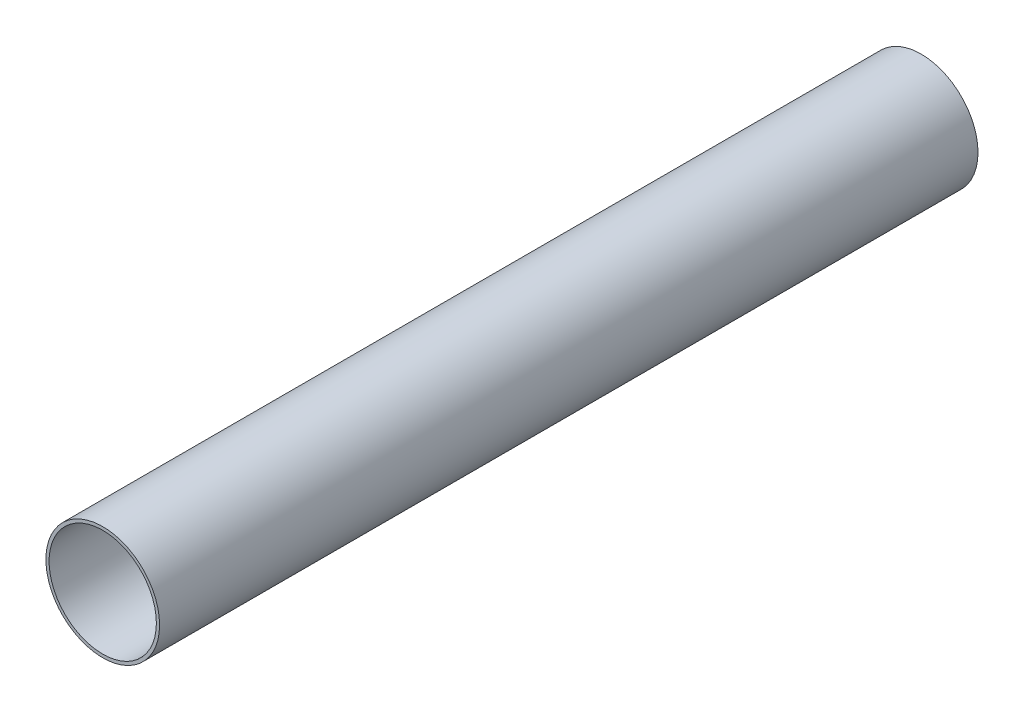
ISO-10303-21;
HEADER;
FILE_DESCRIPTION(('STEP AP214'),'2;1');
FILE_NAME('part.step','',(''),(''),'','','');
FILE_SCHEMA(('AUTOMOTIVE_DESIGN { 1 0 10303 214 1 1 1 1 }'));
ENDSEC;
DATA;
#1=APPLICATION_CONTEXT('core data for automotive mechanical design processes');
#2=APPLICATION_PROTOCOL_DEFINITION('international standard','automotive_design',2000,#1);
#3=PRODUCT_CONTEXT('',#1,'mechanical');
#4=PRODUCT('Part','Part','',(#3));
#5=PRODUCT_RELATED_PRODUCT_CATEGORY('part','',(#4));
#6=PRODUCT_DEFINITION_FORMATION('','',#4);
#7=PRODUCT_DEFINITION_CONTEXT('part definition',#1,'design');
#8=PRODUCT_DEFINITION('design','',#6,#7);
#9=PRODUCT_DEFINITION_SHAPE('','',#8);
#10=(LENGTH_UNIT() NAMED_UNIT(*) SI_UNIT(.MILLI.,.METRE.));
#11=(NAMED_UNIT(*) PLANE_ANGLE_UNIT() SI_UNIT($,.RADIAN.));
#12=(NAMED_UNIT(*) SI_UNIT($,.STERADIAN.) SOLID_ANGLE_UNIT());
#13=UNCERTAINTY_MEASURE_WITH_UNIT(LENGTH_MEASURE(1.E-05),#10,'distance_accuracy_value','');
#14=(GEOMETRIC_REPRESENTATION_CONTEXT(3) GLOBAL_UNCERTAINTY_ASSIGNED_CONTEXT((#13)) GLOBAL_UNIT_ASSIGNED_CONTEXT((#10,
#11,#12)) REPRESENTATION_CONTEXT('',''));
#15=CARTESIAN_POINT('',(0.,0.,0.));
#16=DIRECTION('',(0.,0.,1.));
#17=DIRECTION('',(1.,0.,0.));
#18=AXIS2_PLACEMENT_3D('',#15,#16,#17);
#19=CARTESIAN_POINT('',(0.,0.,457.2));
#20=DIRECTION('',(0.,0.,1.));
#21=DIRECTION('',(1.,0.,0.));
#22=AXIS2_PLACEMENT_3D('',#19,#20,#21);
#23=PLANE('',#22);
#24=CARTESIAN_POINT('',(0.,0.,457.2));
#25=DIRECTION('',(0.,0.,1.));
#26=DIRECTION('',(1.,0.,0.));
#27=AXIS2_PLACEMENT_3D('',#24,#25,#26);
#28=CIRCLE('',#27,31.75);
#29=CARTESIAN_POINT('',(31.75,0.,457.2));
#30=VERTEX_POINT('',#29);
#31=EDGE_CURVE('E10',#30,#30,#28,.T.);
#32=ORIENTED_EDGE('',*,*,#31,.T.);
#33=EDGE_LOOP('',(#32));
#34=FACE_BOUND('',#33,.T.);
#35=CARTESIAN_POINT('',(0.,0.,457.2));
#36=DIRECTION('',(0.,0.,1.));
#37=DIRECTION('',(1.,0.,0.));
#38=AXIS2_PLACEMENT_3D('',#35,#36,#37);
#39=CIRCLE('',#38,29.9640625);
#40=CARTESIAN_POINT('',(29.9640625,0.,457.2));
#41=VERTEX_POINT('',#40);
#42=EDGE_CURVE('E48',#41,#41,#39,.T.);
#43=ORIENTED_EDGE('',*,*,#42,.F.);
#44=EDGE_LOOP('',(#43));
#45=FACE_BOUND('',#44,.T.);
#46=ADVANCED_FACE('F40',(#34,#45),#23,.T.);
#47=CARTESIAN_POINT('',(0.,0.,0.));
#48=DIRECTION('',(0.,0.,1.));
#49=DIRECTION('',(1.,0.,0.));
#50=AXIS2_PLACEMENT_3D('',#47,#48,#49);
#51=PLANE('',#50);
#52=CARTESIAN_POINT('',(0.,0.,0.));
#53=DIRECTION('',(0.,0.,1.));
#54=DIRECTION('',(1.,0.,0.));
#55=AXIS2_PLACEMENT_3D('',#52,#53,#54);
#56=CIRCLE('',#55,31.75);
#57=CARTESIAN_POINT('',(31.75,0.,0.));
#58=VERTEX_POINT('',#57);
#59=EDGE_CURVE('E41',#58,#58,#56,.T.);
#60=ORIENTED_EDGE('',*,*,#59,.F.);
#61=EDGE_LOOP('',(#60));
#62=FACE_BOUND('',#61,.T.);
#63=CARTESIAN_POINT('',(0.,0.,0.));
#64=DIRECTION('',(0.,0.,1.));
#65=DIRECTION('',(1.,0.,0.));
#66=AXIS2_PLACEMENT_3D('',#63,#64,#65);
#67=CIRCLE('',#66,29.9640625);
#68=CARTESIAN_POINT('',(29.9640625,0.,0.));
#69=VERTEX_POINT('',#68);
#70=EDGE_CURVE('E49',#69,#69,#67,.T.);
#71=ORIENTED_EDGE('',*,*,#70,.T.);
#72=EDGE_LOOP('',(#71));
#73=FACE_BOUND('',#72,.T.);
#74=ADVANCED_FACE('F58',(#62,#73),#51,.F.);
#75=CARTESIAN_POINT('',(0.,0.,457.2));
#76=DIRECTION('',(0.,0.,-1.));
#77=DIRECTION('',(-1.,0.,0.));
#78=AXIS2_PLACEMENT_3D('',#75,#76,#77);
#79=CYLINDRICAL_SURFACE('',#78,31.75);
#80=ORIENTED_EDGE('',*,*,#31,.F.);
#81=EDGE_LOOP('',(#80));
#82=FACE_BOUND('',#81,.T.);
#83=ORIENTED_EDGE('',*,*,#59,.T.);
#84=EDGE_LOOP('',(#83));
#85=FACE_BOUND('',#84,.T.);
#86=ADVANCED_FACE('F39',(#82,#85),#79,.T.);
#87=CARTESIAN_POINT('',(0.,0.,457.2));
#88=DIRECTION('',(0.,0.,-1.));
#89=DIRECTION('',(-1.,0.,0.));
#90=AXIS2_PLACEMENT_3D('',#87,#88,#89);
#91=CYLINDRICAL_SURFACE('',#90,29.9640625);
#92=ORIENTED_EDGE('',*,*,#42,.T.);
#93=EDGE_LOOP('',(#92));
#94=FACE_BOUND('',#93,.T.);
#95=ORIENTED_EDGE('',*,*,#70,.F.);
#96=EDGE_LOOP('',(#95));
#97=FACE_BOUND('',#96,.T.);
#98=ADVANCED_FACE('F57',(#94,#97),#91,.F.);
#99=CLOSED_SHELL('',(#46,#74,#86,#98));
#100=MANIFOLD_SOLID_BREP('B2',#99);
#101=ADVANCED_BREP_SHAPE_REPRESENTATION('',(#18,#100),#14);
#102=SHAPE_DEFINITION_REPRESENTATION(#9,#101);
ENDSEC;
END-ISO-10303-21;
